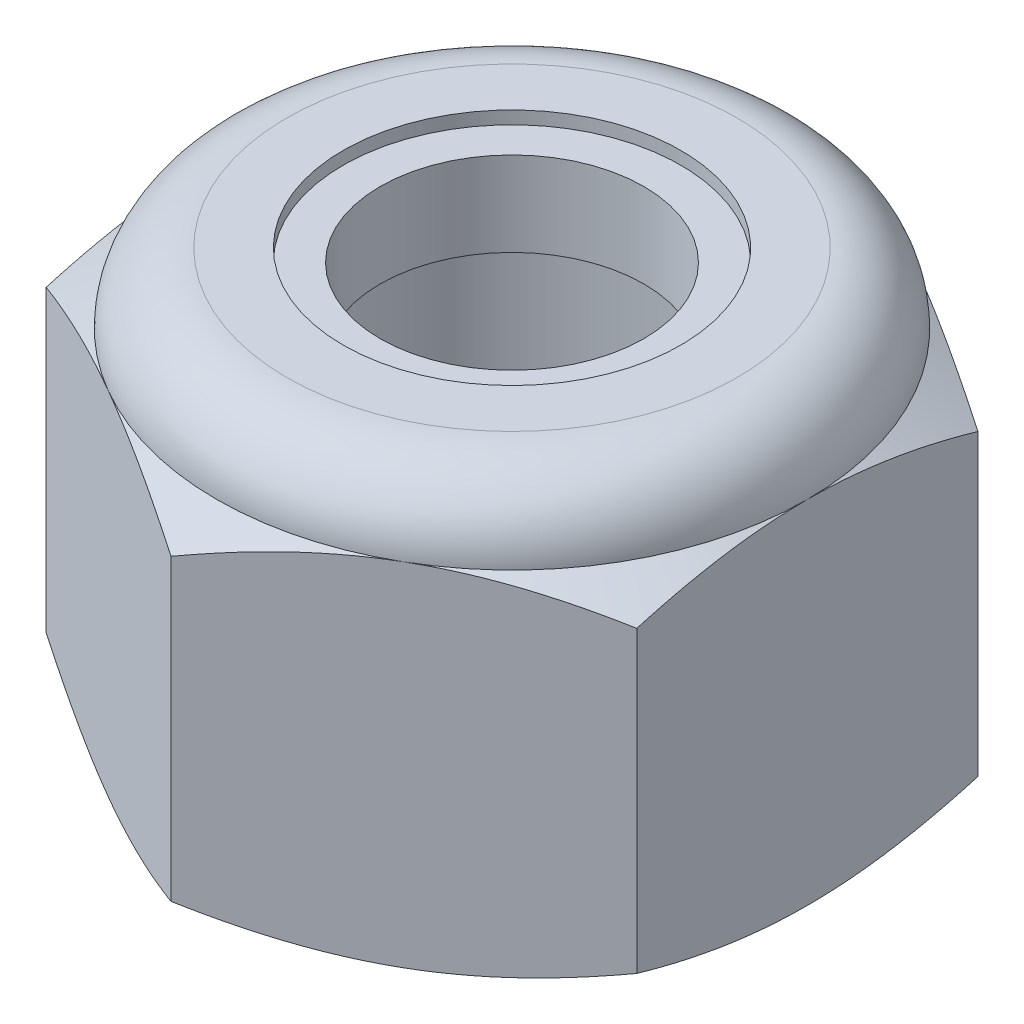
ISO-10303-21;
HEADER;
FILE_DESCRIPTION(('STEP AP214'),'2;1');
FILE_NAME('part.step','',(''),(''),'','','');
FILE_SCHEMA(('AUTOMOTIVE_DESIGN { 1 0 10303 214 1 1 1 1 }'));
ENDSEC;
DATA;
#1=APPLICATION_CONTEXT('core data for automotive mechanical design processes');
#2=APPLICATION_PROTOCOL_DEFINITION('international standard','automotive_design',2000,#1);
#3=PRODUCT_CONTEXT('',#1,'mechanical');
#4=PRODUCT('Part','Part','',(#3));
#5=PRODUCT_RELATED_PRODUCT_CATEGORY('part','',(#4));
#6=PRODUCT_DEFINITION_FORMATION('','',#4);
#7=PRODUCT_DEFINITION_CONTEXT('part definition',#1,'design');
#8=PRODUCT_DEFINITION('design','',#6,#7);
#9=PRODUCT_DEFINITION_SHAPE('','',#8);
#10=(LENGTH_UNIT() NAMED_UNIT(*) SI_UNIT(.MILLI.,.METRE.));
#11=(NAMED_UNIT(*) PLANE_ANGLE_UNIT() SI_UNIT($,.RADIAN.));
#12=(NAMED_UNIT(*) SI_UNIT($,.STERADIAN.) SOLID_ANGLE_UNIT());
#13=UNCERTAINTY_MEASURE_WITH_UNIT(LENGTH_MEASURE(1.E-05),#10,'distance_accuracy_value','');
#14=(GEOMETRIC_REPRESENTATION_CONTEXT(3) GLOBAL_UNCERTAINTY_ASSIGNED_CONTEXT((#13)) GLOBAL_UNIT_ASSIGNED_CONTEXT((#10,
#11,#12)) REPRESENTATION_CONTEXT('',''));
#15=CARTESIAN_POINT('',(0.,0.,0.));
#16=DIRECTION('',(0.,0.,1.));
#17=DIRECTION('',(1.,0.,0.));
#18=AXIS2_PLACEMENT_3D('',#15,#16,#17);
#19=CARTESIAN_POINT('',(0.,3.8476,0.));
#20=DIRECTION('',(0.,1.,0.));
#21=DIRECTION('',(0.,0.,1.));
#22=AXIS2_PLACEMENT_3D('',#19,#20,#21);
#23=CYLINDRICAL_SURFACE('',#22,2.);
#24=CARTESIAN_POINT('',(0.,3.8476,0.));
#25=DIRECTION('',(0.,1.,0.));
#26=DIRECTION('',(0.,0.,1.));
#27=AXIS2_PLACEMENT_3D('',#24,#25,#26);
#28=CIRCLE('',#27,2.);
#29=CARTESIAN_POINT('',(0.,3.8476,2.));
#30=VERTEX_POINT('',#29);
#31=EDGE_CURVE('E12',#30,#30,#28,.T.);
#32=ORIENTED_EDGE('',*,*,#31,.T.);
#33=EDGE_LOOP('',(#32));
#34=FACE_BOUND('',#33,.T.);
#35=CARTESIAN_POINT('',(0.,4.8476,0.));
#36=DIRECTION('',(0.,1.,0.));
#37=DIRECTION('',(0.,0.,1.));
#38=AXIS2_PLACEMENT_3D('',#35,#36,#37);
#39=CIRCLE('',#38,2.);
#40=CARTESIAN_POINT('',(0.,4.8476,2.));
#41=VERTEX_POINT('',#40);
#42=EDGE_CURVE('E48',#41,#41,#39,.T.);
#43=ORIENTED_EDGE('',*,*,#42,.F.);
#44=EDGE_LOOP('',(#43));
#45=FACE_BOUND('',#44,.T.);
#46=ADVANCED_FACE('F45',(#34,#45),#23,.T.);
#47=CARTESIAN_POINT('',(0.,3.8476,0.));
#48=DIRECTION('',(0.,1.,0.));
#49=DIRECTION('',(0.,0.,1.));
#50=AXIS2_PLACEMENT_3D('',#47,#48,#49);
#51=PLANE('',#50);
#52=CARTESIAN_POINT('',(0.,3.8476,0.));
#53=DIRECTION('',(0.,1.,0.));
#54=DIRECTION('',(0.,0.,1.));
#55=AXIS2_PLACEMENT_3D('',#52,#53,#54);
#56=CIRCLE('',#55,1.5625);
#57=CARTESIAN_POINT('',(0.,3.8476,1.5625));
#58=VERTEX_POINT('',#57);
#59=EDGE_CURVE('E55',#58,#58,#56,.T.);
#60=ORIENTED_EDGE('',*,*,#59,.T.);
#61=EDGE_LOOP('',(#60));
#62=FACE_BOUND('',#61,.T.);
#63=ORIENTED_EDGE('',*,*,#31,.F.);
#64=EDGE_LOOP('',(#63));
#65=FACE_BOUND('',#64,.T.);
#66=ADVANCED_FACE('F63',(#62,#65),#51,.F.);
#67=CARTESIAN_POINT('',(0.,4.8476,0.));
#68=DIRECTION('',(0.,1.,0.));
#69=DIRECTION('',(0.,0.,1.));
#70=AXIS2_PLACEMENT_3D('',#67,#68,#69);
#71=PLANE('',#70);
#72=CARTESIAN_POINT('',(0.,4.8476,0.));
#73=DIRECTION('',(0.,1.,0.));
#74=DIRECTION('',(0.,0.,1.));
#75=AXIS2_PLACEMENT_3D('',#72,#73,#74);
#76=CIRCLE('',#75,1.5625);
#77=CARTESIAN_POINT('',(0.,4.8476,1.5625));
#78=VERTEX_POINT('',#77);
#79=EDGE_CURVE('E57',#78,#78,#76,.T.);
#80=ORIENTED_EDGE('',*,*,#79,.F.);
#81=EDGE_LOOP('',(#80));
#82=FACE_BOUND('',#81,.T.);
#83=ORIENTED_EDGE('',*,*,#42,.T.);
#84=EDGE_LOOP('',(#83));
#85=FACE_BOUND('',#84,.T.);
#86=ADVANCED_FACE('F69',(#82,#85),#71,.T.);
#87=CARTESIAN_POINT('',(0.,3.8476,0.));
#88=DIRECTION('',(0.,1.,0.));
#89=DIRECTION('',(0.,0.,1.));
#90=AXIS2_PLACEMENT_3D('',#87,#88,#89);
#91=CYLINDRICAL_SURFACE('',#90,1.5625);
#92=ORIENTED_EDGE('',*,*,#59,.F.);
#93=EDGE_LOOP('',(#92));
#94=FACE_BOUND('',#93,.T.);
#95=ORIENTED_EDGE('',*,*,#79,.T.);
#96=EDGE_LOOP('',(#95));
#97=FACE_BOUND('',#96,.T.);
#98=ADVANCED_FACE('F66',(#94,#97),#91,.F.);
#99=CLOSED_SHELL('',(#46,#66,#86,#98));
#100=MANIFOLD_SOLID_BREP('B2',#99);
#101=CARTESIAN_POINT('',(3.5,5.,-2.0207259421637));
#102=DIRECTION('',(-0.5,0.,0.866025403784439));
#103=DIRECTION('',(0.866025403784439,0.,0.5));
#104=AXIS2_PLACEMENT_3D('',#101,#102,#103);
#105=PLANE('',#104);
#106=CARTESIAN_POINT('',(-0.000199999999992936,0.31267406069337,-4.04156735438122));
#107=CARTESIAN_POINT('',(0.153607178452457,0.261385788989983,-3.9527667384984));
#108=CARTESIAN_POINT('',(0.308742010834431,0.214740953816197,-3.86319960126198));
#109=CARTESIAN_POINT('',(0.621698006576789,0.133321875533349,-3.68251437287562));
#110=CARTESIAN_POINT('',(0.779524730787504,0.0985764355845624,-3.59139307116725));
#111=CARTESIAN_POINT('',(1.09322221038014,0.0444900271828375,-3.41027974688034));
#112=CARTESIAN_POINT('',(1.2490446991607,0.0247890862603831,-3.32031559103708));
#113=CARTESIAN_POINT('',(1.56142288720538,0.00127013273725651,-3.13996396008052));
#114=CARTESIAN_POINT('',(1.71797745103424,-0.0025673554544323,-3.04957714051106));
#115=CARTESIAN_POINT('',(2.010509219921,0.00541530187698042,-2.88068384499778));
#116=CARTESIAN_POINT('',(2.14653021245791,0.0152754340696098,-2.80215208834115));
#117=CARTESIAN_POINT('',(2.417686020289,0.046526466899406,-2.64560020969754));
#118=CARTESIAN_POINT('',(2.55281989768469,0.0679280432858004,-2.5675806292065));
#119=CARTESIAN_POINT('',(2.82453479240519,0.121430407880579,-2.41070596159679));
#120=CARTESIAN_POINT('',(2.96108141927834,0.153757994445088,-2.33187072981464));
#121=CARTESIAN_POINT('',(3.2321380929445,0.227128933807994,-2.17537608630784));
#122=CARTESIAN_POINT('',(3.36665161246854,0.268155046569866,-2.09771466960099));
#123=CARTESIAN_POINT('',(3.5002,0.31267406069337,-2.02061047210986));
#124=B_SPLINE_CURVE_WITH_KNOTS('',3,(#106,#107,#108,#109,#110,#111,#112,#113,#114,#115,#116,
#117,#118,#119,#120,#121,#122,#123),.UNSPECIFIED.,.F.,.F.,(4,2,2,2,2,2,2,2,4),(0.,
0.554793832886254,1.11092123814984,1.65328467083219,2.19498204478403,2.6666513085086,
3.13875761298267,3.62133612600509,4.10296698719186),.UNSPECIFIED.);
#125=CARTESIAN_POINT('',(0.,0.312607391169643,-4.04145188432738));
#126=VERTEX_POINT('',#125);
#127=CARTESIAN_POINT('',(1.75,0.,-3.03108891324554));
#128=VERTEX_POINT('',#127);
#129=EDGE_CURVE('E229',#126,#128,#124,.T.);
#130=ORIENTED_EDGE('',*,*,#129,.F.);
#131=DIRECTION('',(0.,-1.,0.));
#132=VECTOR('',#131,1.);
#133=CARTESIAN_POINT('',(0.,5.,-4.04145188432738));
#134=LINE('',#133,#132);
#135=CARTESIAN_POINT('',(0.,3.85405927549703,-4.04145188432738));
#136=VERTEX_POINT('',#135);
#137=EDGE_CURVE('E352',#136,#126,#134,.T.);
#138=ORIENTED_EDGE('',*,*,#137,.F.);
#139=CARTESIAN_POINT('',(3.5002,3.8539926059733,-2.02061047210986));
#140=CARTESIAN_POINT('',(3.34639282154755,3.90528087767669,-2.10941108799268));
#141=CARTESIAN_POINT('',(3.19125798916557,3.95192571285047,-2.1989782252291));
#142=CARTESIAN_POINT('',(2.87830199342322,4.03334479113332,-2.37966345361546));
#143=CARTESIAN_POINT('',(2.7204752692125,4.0680902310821,-2.47078475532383));
#144=CARTESIAN_POINT('',(2.40677778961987,4.12217663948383,-2.65189807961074));
#145=CARTESIAN_POINT('',(2.25095530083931,4.14187758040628,-2.741862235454));
#146=CARTESIAN_POINT('',(1.93857711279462,4.16539653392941,-2.92221386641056));
#147=CARTESIAN_POINT('',(1.78202254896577,4.1692340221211,-3.01260068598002));
#148=CARTESIAN_POINT('',(1.48949078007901,4.16125136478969,-3.18149398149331));
#149=CARTESIAN_POINT('',(1.35346978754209,4.15139123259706,-3.26002573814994));
#150=CARTESIAN_POINT('',(1.08231397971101,4.12014019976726,-3.41657761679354));
#151=CARTESIAN_POINT('',(0.947180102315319,4.09873862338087,-3.49459719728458));
#152=CARTESIAN_POINT('',(0.675465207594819,4.04523625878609,-3.65147186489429));
#153=CARTESIAN_POINT('',(0.538918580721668,4.01290867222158,-3.73030709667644));
#154=CARTESIAN_POINT('',(0.267861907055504,3.93953773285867,-3.88680174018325));
#155=CARTESIAN_POINT('',(0.13334838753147,3.8985116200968,-3.96446315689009));
#156=CARTESIAN_POINT('',(-0.000199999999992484,3.8539926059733,-4.04156735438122));
#157=B_SPLINE_CURVE_WITH_KNOTS('',3,(#139,#140,#141,#142,#143,#144,#145,#146,#147,#148,#149,
#150,#151,#152,#153,#154,#155,#156),.UNSPECIFIED.,.F.,.F.,(4,2,2,2,2,2,2,2,4),(0.,
0.554793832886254,1.11092123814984,1.65328467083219,2.19498204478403,2.6666513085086,
3.13875761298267,3.62133612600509,4.10296698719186),.UNSPECIFIED.);
#158=CARTESIAN_POINT('',(1.75,4.16666666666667,-3.03108891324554));
#159=VERTEX_POINT('',#158);
#160=EDGE_CURVE('E320',#159,#136,#157,.T.);
#161=ORIENTED_EDGE('',*,*,#160,.F.);
#162=CARTESIAN_POINT('',(3.5,3.85405927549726,-2.02072594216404));
#163=VERTEX_POINT('',#162);
#164=EDGE_CURVE('E375',#163,#159,#157,.T.);
#165=ORIENTED_EDGE('',*,*,#164,.F.);
#166=DIRECTION('',(0.,-1.,0.));
#167=VECTOR('',#166,1.);
#168=CARTESIAN_POINT('',(3.5,5.,-2.0207259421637));
#169=LINE('',#168,#167);
#170=CARTESIAN_POINT('',(3.5,0.312607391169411,-2.02072594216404));
#171=VERTEX_POINT('',#170);
#172=EDGE_CURVE('E361',#163,#171,#169,.T.);
#173=ORIENTED_EDGE('',*,*,#172,.T.);
#174=EDGE_CURVE('E210',#128,#171,#124,.T.);
#175=ORIENTED_EDGE('',*,*,#174,.F.);
#176=EDGE_LOOP('',(#130,#138,#161,#165,#173,#175));
#177=FACE_BOUND('',#176,.T.);
#178=ADVANCED_FACE('F113',(#177),#105,.F.);
#179=CARTESIAN_POINT('',(0.,5.,-4.04145188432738));
#180=DIRECTION('',(0.499999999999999,0.,0.866025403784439));
#181=DIRECTION('',(0.866025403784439,0.,-0.499999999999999));
#182=AXIS2_PLACEMENT_3D('',#179,#180,#181);
#183=PLANE('',#182);
#184=CARTESIAN_POINT('',(-3.5002,0.31267406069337,-2.02061047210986));
#185=CARTESIAN_POINT('',(-3.34639282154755,0.261385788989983,-2.10941108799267));
#186=CARTESIAN_POINT('',(-3.19125798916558,0.214740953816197,-2.19897822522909));
#187=CARTESIAN_POINT('',(-2.87830199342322,0.133321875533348,-2.37966345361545));
#188=CARTESIAN_POINT('',(-2.7204752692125,0.0985764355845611,-2.47078475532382));
#189=CARTESIAN_POINT('',(-2.40677778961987,0.0444900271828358,-2.65189807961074));
#190=CARTESIAN_POINT('',(-2.25095530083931,0.0247890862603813,-2.74186223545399));
#191=CARTESIAN_POINT('',(-1.93857711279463,0.00127013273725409,-2.92221386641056));
#192=CARTESIAN_POINT('',(-1.78202254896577,-0.00256735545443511,-3.01260068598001));
#193=CARTESIAN_POINT('',(-1.48949078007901,0.00541530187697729,-3.1814939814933));
#194=CARTESIAN_POINT('',(-1.35346978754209,0.0152754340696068,-3.26002573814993));
#195=CARTESIAN_POINT('',(-1.082313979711,0.0465264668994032,-3.41657761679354));
#196=CARTESIAN_POINT('',(-0.947180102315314,0.0679280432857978,-3.49459719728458));
#197=CARTESIAN_POINT('',(-0.675465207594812,0.121430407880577,-3.65147186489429));
#198=CARTESIAN_POINT('',(-0.53891858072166,0.153757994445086,-3.73030709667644));
#199=CARTESIAN_POINT('',(-0.267861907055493,0.227128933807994,-3.88680174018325));
#200=CARTESIAN_POINT('',(-0.133348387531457,0.268155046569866,-3.96446315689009));
#201=CARTESIAN_POINT('',(0.000200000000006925,0.31267406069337,-4.04156735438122));
#202=B_SPLINE_CURVE_WITH_KNOTS('',3,(#184,#185,#186,#187,#188,#189,#190,#191,#192,#193,#194,
#195,#196,#197,#198,#199,#200,#201),.UNSPECIFIED.,.F.,.F.,(4,2,2,2,2,2,2,2,4),(0.,
0.554793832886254,1.11092123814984,1.65328467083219,2.19498204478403,2.6666513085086,
3.13875761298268,3.6213361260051,4.10296698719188),.UNSPECIFIED.);
#203=CARTESIAN_POINT('',(-3.5,0.312607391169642,-2.02072594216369));
#204=VERTEX_POINT('',#203);
#205=CARTESIAN_POINT('',(-1.75,0.,-3.03108891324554));
#206=VERTEX_POINT('',#205);
#207=EDGE_CURVE('E340',#204,#206,#202,.T.);
#208=ORIENTED_EDGE('',*,*,#207,.F.);
#209=DIRECTION('',(0.,-1.,0.));
#210=VECTOR('',#209,1.);
#211=CARTESIAN_POINT('',(-3.5,5.,-2.02072594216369));
#212=LINE('',#211,#210);
#213=CARTESIAN_POINT('',(-3.5,3.85405927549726,-2.02072594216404));
#214=VERTEX_POINT('',#213);
#215=EDGE_CURVE('E343',#214,#204,#212,.T.);
#216=ORIENTED_EDGE('',*,*,#215,.F.);
#217=CARTESIAN_POINT('',(0.000200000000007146,3.8539926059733,-4.04156735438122));
#218=CARTESIAN_POINT('',(-0.153607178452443,3.90528087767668,-3.9527667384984));
#219=CARTESIAN_POINT('',(-0.308742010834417,3.95192571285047,-3.86319960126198));
#220=CARTESIAN_POINT('',(-0.621698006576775,4.03334479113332,-3.68251437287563));
#221=CARTESIAN_POINT('',(-0.77952473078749,4.06809023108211,-3.59139307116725));
#222=CARTESIAN_POINT('',(-1.09322221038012,4.12217663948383,-3.41027974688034));
#223=CARTESIAN_POINT('',(-1.24904469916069,4.14187758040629,-3.32031559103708));
#224=CARTESIAN_POINT('',(-1.56142288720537,4.16539653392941,-3.13996396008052));
#225=CARTESIAN_POINT('',(-1.71797745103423,4.1692340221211,-3.04957714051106));
#226=CARTESIAN_POINT('',(-2.01050921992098,4.16125136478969,-2.88068384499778));
#227=CARTESIAN_POINT('',(-2.1465302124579,4.15139123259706,-2.80215208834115));
#228=CARTESIAN_POINT('',(-2.41768602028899,4.12014019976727,-2.64560020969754));
#229=CARTESIAN_POINT('',(-2.55281989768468,4.09873862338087,-2.5675806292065));
#230=CARTESIAN_POINT('',(-2.82453479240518,4.04523625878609,-2.41070596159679));
#231=CARTESIAN_POINT('',(-2.96108141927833,4.01290867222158,-2.33187072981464));
#232=CARTESIAN_POINT('',(-3.2321380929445,3.93953773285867,-2.17537608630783));
#233=CARTESIAN_POINT('',(-3.36665161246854,3.8985116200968,-2.09771466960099));
#234=CARTESIAN_POINT('',(-3.5002,3.8539926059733,-2.02061047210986));
#235=B_SPLINE_CURVE_WITH_KNOTS('',3,(#217,#218,#219,#220,#221,#222,#223,#224,#225,#226,#227,
#228,#229,#230,#231,#232,#233,#234),.UNSPECIFIED.,.F.,.F.,(4,2,2,2,2,2,2,2,4),(0.,
0.554793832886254,1.11092123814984,1.65328467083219,2.19498204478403,2.6666513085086,
3.13875761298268,3.6213361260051,4.10296698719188),.UNSPECIFIED.);
#236=CARTESIAN_POINT('',(-1.75,4.16666666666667,-3.03108891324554));
#237=VERTEX_POINT('',#236);
#238=EDGE_CURVE('E313',#237,#214,#235,.T.);
#239=ORIENTED_EDGE('',*,*,#238,.F.);
#240=EDGE_CURVE('E319',#136,#237,#235,.T.);
#241=ORIENTED_EDGE('',*,*,#240,.F.);
#242=ORIENTED_EDGE('',*,*,#137,.T.);
#243=EDGE_CURVE('E230',#206,#126,#202,.T.);
#244=ORIENTED_EDGE('',*,*,#243,.F.);
#245=EDGE_LOOP('',(#208,#216,#239,#241,#242,#244));
#246=FACE_BOUND('',#245,.T.);
#247=ADVANCED_FACE('F326',(#246),#183,.F.);
#248=CARTESIAN_POINT('',(-3.5,5.,-2.02072594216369));
#249=DIRECTION('',(1.,0.,0.));
#250=DIRECTION('',(0.,0.,-1.));
#251=AXIS2_PLACEMENT_3D('',#248,#249,#250);
#252=PLANE('',#251);
#253=CARTESIAN_POINT('',(-3.5,1.72418329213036,-5.46104710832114));
#254=CARTESIAN_POINT('',(-3.5,1.64973387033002,-5.30784491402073));
#255=CARTESIAN_POINT('',(-3.5,1.57598898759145,-5.15429446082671));
#256=CARTESIAN_POINT('',(-3.5,1.43030407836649,-4.84631185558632));
#257=CARTESIAN_POINT('',(-3.5,1.35836433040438,-4.69187957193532));
#258=CARTESIAN_POINT('',(-3.5,1.21633091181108,-4.38116889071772));
#259=CARTESIAN_POINT('',(-3.5,1.1462491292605,-4.22488504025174));
#260=CARTESIAN_POINT('',(-3.5,1.00891129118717,-3.91108522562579));
#261=CARTESIAN_POINT('',(-3.5,0.941655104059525,-3.75356931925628));
#262=CARTESIAN_POINT('',(-3.5,0.808604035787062,-3.43195522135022));
#263=CARTESIAN_POINT('',(-3.5,0.742925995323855,-3.26780843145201));
#264=CARTESIAN_POINT('',(-3.5,0.616460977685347,-2.93760703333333));
#265=CARTESIAN_POINT('',(-3.5,0.555674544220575,-2.77155221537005));
#266=CARTESIAN_POINT('',(-3.5,0.440563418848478,-2.43757026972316));
#267=CARTESIAN_POINT('',(-3.5,0.386225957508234,-2.269647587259));
#268=CARTESIAN_POINT('',(-3.5,0.285733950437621,-1.93139420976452));
#269=CARTESIAN_POINT('',(-3.5,0.239576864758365,-1.76106427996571));
#270=CARTESIAN_POINT('',(-3.5,0.157871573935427,-1.41879566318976));
#271=CARTESIAN_POINT('',(-3.5,0.122267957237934,-1.24687044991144));
#272=CARTESIAN_POINT('',(-3.5,0.0636788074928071,-0.900848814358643));
#273=CARTESIAN_POINT('',(-3.5,0.0406919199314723,-0.726752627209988));
#274=CARTESIAN_POINT('',(-3.5,0.00946908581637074,-0.379544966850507));
#275=CARTESIAN_POINT('',(-3.5,0.00104093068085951,-0.206451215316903));
#276=CARTESIAN_POINT('',(-3.5,-0.000857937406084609,0.139837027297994));
#277=CARTESIAN_POINT('',(-3.5,0.00567185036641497,0.313031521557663));
#278=CARTESIAN_POINT('',(-3.5,0.0289039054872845,0.605999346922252));
#279=CARTESIAN_POINT('',(-3.5,0.0419310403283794,0.726082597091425));
#280=CARTESIAN_POINT('',(-3.5,0.0743836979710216,0.965387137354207));
#281=CARTESIAN_POINT('',(-3.5,0.0938100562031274,1.0846083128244));
#282=CARTESIAN_POINT('',(-3.5,0.160668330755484,1.44080185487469));
#283=CARTESIAN_POINT('',(-3.5,0.216668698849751,1.67618474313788));
#284=CARTESIAN_POINT('',(-3.5,0.314033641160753,2.0283688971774));
#285=CARTESIAN_POINT('',(-3.5,0.349205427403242,2.14698601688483));
#286=CARTESIAN_POINT('',(-3.5,0.423259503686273,2.38306754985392));
#287=CARTESIAN_POINT('',(-3.5,0.462141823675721,2.5005319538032));
#288=CARTESIAN_POINT('',(-3.5,0.542988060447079,2.73434747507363));
#289=CARTESIAN_POINT('',(-3.5,0.584951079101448,2.85069890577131));
#290=CARTESIAN_POINT('',(-3.5,0.671459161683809,3.08243090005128));
#291=CARTESIAN_POINT('',(-3.5,0.716004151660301,3.19781149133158));
#292=CARTESIAN_POINT('',(-3.5,0.847875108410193,3.53010242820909));
#293=CARTESIAN_POINT('',(-3.5,0.937968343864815,3.74591384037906));
#294=CARTESIAN_POINT('',(-3.5,1.1236764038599,4.17515714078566));
#295=CARTESIAN_POINT('',(-3.5,1.21929198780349,4.38858869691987));
#296=CARTESIAN_POINT('',(-3.5,1.41462237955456,4.81366884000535));
#297=CARTESIAN_POINT('',(-3.5,1.51433887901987,5.0253166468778));
#298=CARTESIAN_POINT('',(-3.5,1.71682010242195,5.44715232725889));
#299=CARTESIAN_POINT('',(-3.5,1.81958492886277,5.65734015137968));
#300=CARTESIAN_POINT('',(-3.5,2.02762659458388,6.07692723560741));
#301=CARTESIAN_POINT('',(-3.5,2.1329075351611,6.28632445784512));
#302=CARTESIAN_POINT('',(-3.5,2.34529474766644,6.70419213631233));
#303=CARTESIAN_POINT('',(-3.5,2.45240103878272,6.91266258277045));
#304=CARTESIAN_POINT('',(-3.5,2.77580685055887,7.53685082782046));
#305=CARTESIAN_POINT('',(-3.5,2.99424943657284,7.95145760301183));
#306=CARTESIAN_POINT('',(-3.5,3.40900389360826,8.73014947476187));
#307=CARTESIAN_POINT('',(-3.5,3.60490503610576,9.09445438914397));
#308=CARTESIAN_POINT('',(-3.5,3.9988212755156,9.82195451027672));
#309=CARTESIAN_POINT('',(-3.5,4.19683653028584,10.1851496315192));
#310=CARTESIAN_POINT('',(-3.5,4.59369841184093,10.9093913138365));
#311=CARTESIAN_POINT('',(-3.5,4.79253950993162,11.2704409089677));
#312=CARTESIAN_POINT('',(-3.5,5.1913927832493,11.9918505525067));
#313=CARTESIAN_POINT('',(-3.5,5.39140485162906,12.3522106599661));
#314=CARTESIAN_POINT('',(-3.5,5.59183923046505,12.712334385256));
#315=B_SPLINE_CURVE_WITH_KNOTS('',3,(#253,#254,#255,#256,#257,#258,#259,#260,#261,#262,#263,
#264,#265,#266,#267,#268,#269,#270,#271,#272,#273,#274,#275,#276,#277,#278,#279,#280,#281,#282,
#283,#284,#285,#286,#287,#288,#289,#290,#291,#292,#293,#294,#295,#296,#297,#298,#299,#300,#301,
#302,#303,#304,#305,#306,#307,#308,#309,#310,#311,#312,#313,#314),.UNSPECIFIED.,.F.,.F.,(4,2,2,
2,2,2,2,2,2,2,2,2,2,2,2,2,2,2,2,2,2,2,2,2,2,2,2,2,2,2,4),(0.,0.511007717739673,1.02209380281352,
1.5359049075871,2.04969205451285,2.58002782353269,3.11042245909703,3.63974870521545,
4.16891031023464,4.69524219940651,5.22151757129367,5.74079023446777,6.26008028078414,
6.62226887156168,6.98450476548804,7.70933484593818,8.08046770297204,8.45160355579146,
8.82263163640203,9.19364909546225,9.89511289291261,10.5966733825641,11.298526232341,
12.0004027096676,12.7035139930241,13.4066326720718,14.8124940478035,16.0533973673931,
17.2943940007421,18.5309398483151,19.7673745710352),.UNSPECIFIED.);
#316=CARTESIAN_POINT('',(-3.5,0.312607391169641,2.02072594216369));
#317=VERTEX_POINT('',#316);
#318=CARTESIAN_POINT('',(-3.5,0.,0.));
#319=VERTEX_POINT('',#318);
#320=EDGE_CURVE('E417',#317,#319,#315,.F.);
#321=ORIENTED_EDGE('',*,*,#320,.F.);
#322=DIRECTION('',(0.,-1.,0.));
#323=VECTOR('',#322,1.);
#324=CARTESIAN_POINT('',(-3.5,5.,2.02072594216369));
#325=LINE('',#324,#323);
#326=CARTESIAN_POINT('',(-3.5,3.85405927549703,2.02072594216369));
#327=VERTEX_POINT('',#326);
#328=EDGE_CURVE('E353',#327,#317,#325,.T.);
#329=ORIENTED_EDGE('',*,*,#328,.F.);
#330=CARTESIAN_POINT('',(-3.5,2.44248337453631,-5.46104710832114));
#331=CARTESIAN_POINT('',(-3.5,2.51693279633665,-5.30784491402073));
#332=CARTESIAN_POINT('',(-3.5,2.59067767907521,-5.15429446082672));
#333=CARTESIAN_POINT('',(-3.5,2.73636258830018,-4.84631185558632));
#334=CARTESIAN_POINT('',(-3.5,2.80830233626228,-4.69187957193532));
#335=CARTESIAN_POINT('',(-3.5,2.95033575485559,-4.38116889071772));
#336=CARTESIAN_POINT('',(-3.5,3.02041753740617,-4.22488504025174));
#337=CARTESIAN_POINT('',(-3.5,3.1577553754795,-3.91108522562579));
#338=CARTESIAN_POINT('',(-3.5,3.22501156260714,-3.75356931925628));
#339=CARTESIAN_POINT('',(-3.5,3.35806263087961,-3.43195522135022));
#340=CARTESIAN_POINT('',(-3.5,3.42374067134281,-3.26780843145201));
#341=CARTESIAN_POINT('',(-3.5,3.55020568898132,-2.93760703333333));
#342=CARTESIAN_POINT('',(-3.5,3.61099212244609,-2.77155221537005));
#343=CARTESIAN_POINT('',(-3.5,3.72610324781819,-2.43757026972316));
#344=CARTESIAN_POINT('',(-3.5,3.78044070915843,-2.269647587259));
#345=CARTESIAN_POINT('',(-3.5,3.88093271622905,-1.93139420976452));
#346=CARTESIAN_POINT('',(-3.5,3.9270898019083,-1.76106427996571));
#347=CARTESIAN_POINT('',(-3.5,4.00879509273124,-1.41879566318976));
#348=CARTESIAN_POINT('',(-3.5,4.04439870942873,-1.24687044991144));
#349=CARTESIAN_POINT('',(-3.5,4.10298785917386,-0.900848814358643));
#350=CARTESIAN_POINT('',(-3.5,4.1259747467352,-0.726752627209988));
#351=CARTESIAN_POINT('',(-3.5,4.1571975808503,-0.379544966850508));
#352=CARTESIAN_POINT('',(-3.5,4.16562573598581,-0.206451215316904));
#353=CARTESIAN_POINT('',(-3.5,4.16752460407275,0.139837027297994));
#354=CARTESIAN_POINT('',(-3.5,4.16099481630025,0.313031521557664));
#355=CARTESIAN_POINT('',(-3.5,4.13776276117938,0.605999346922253));
#356=CARTESIAN_POINT('',(-3.5,4.12473562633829,0.726082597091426));
#357=CARTESIAN_POINT('',(-3.5,4.09228296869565,0.965387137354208));
#358=CARTESIAN_POINT('',(-3.5,4.07285661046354,1.0846083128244));
#359=CARTESIAN_POINT('',(-3.5,4.00599833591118,1.44080185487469));
#360=CARTESIAN_POINT('',(-3.5,3.94999796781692,1.67618474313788));
#361=CARTESIAN_POINT('',(-3.5,3.85263302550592,2.0283688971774));
#362=CARTESIAN_POINT('',(-3.5,3.81746123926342,2.14698601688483));
#363=CARTESIAN_POINT('',(-3.5,3.74340716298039,2.38306754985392));
#364=CARTESIAN_POINT('',(-3.5,3.70452484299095,2.5005319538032));
#365=CARTESIAN_POINT('',(-3.5,3.62367860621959,2.73434747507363));
#366=CARTESIAN_POINT('',(-3.5,3.58171558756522,2.85069890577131));
#367=CARTESIAN_POINT('',(-3.5,3.49520750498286,3.08243090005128));
#368=CARTESIAN_POINT('',(-3.5,3.45066251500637,3.19781149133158));
#369=CARTESIAN_POINT('',(-3.5,3.31879155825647,3.53010242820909));
#370=CARTESIAN_POINT('',(-3.5,3.22869832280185,3.74591384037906));
#371=CARTESIAN_POINT('',(-3.5,3.04299026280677,4.17515714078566));
#372=CARTESIAN_POINT('',(-3.5,2.94737467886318,4.38858869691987));
#373=CARTESIAN_POINT('',(-3.5,2.75204428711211,4.81366884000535));
#374=CARTESIAN_POINT('',(-3.5,2.6523277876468,5.0253166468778));
#375=CARTESIAN_POINT('',(-3.5,2.44984656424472,5.44715232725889));
#376=CARTESIAN_POINT('',(-3.5,2.34708173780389,5.65734015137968));
#377=CARTESIAN_POINT('',(-3.5,2.13904007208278,6.07692723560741));
#378=CARTESIAN_POINT('',(-3.5,2.03375913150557,6.28632445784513));
#379=CARTESIAN_POINT('',(-3.5,1.82137191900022,6.70419213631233));
#380=CARTESIAN_POINT('',(-3.5,1.71426562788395,6.91266258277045));
#381=CARTESIAN_POINT('',(-3.5,1.3908598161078,7.53685082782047));
#382=CARTESIAN_POINT('',(-3.5,1.17241723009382,7.95145760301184));
#383=CARTESIAN_POINT('',(-3.5,0.757662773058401,8.73014947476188));
#384=CARTESIAN_POINT('',(-3.5,0.561761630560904,9.09445438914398));
#385=CARTESIAN_POINT('',(-3.5,0.167845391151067,9.82195451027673));
#386=CARTESIAN_POINT('',(-3.5,-0.0301698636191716,10.1851496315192));
#387=CARTESIAN_POINT('',(-3.5,-0.427031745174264,10.9093913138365));
#388=CARTESIAN_POINT('',(-3.5,-0.625872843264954,11.2704409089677));
#389=CARTESIAN_POINT('',(-3.5,-1.02472611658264,11.9918505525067));
#390=CARTESIAN_POINT('',(-3.5,-1.2247381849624,12.3522106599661));
#391=CARTESIAN_POINT('',(-3.5,-1.42517256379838,12.712334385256));
#392=B_SPLINE_CURVE_WITH_KNOTS('',3,(#330,#331,#332,#333,#334,#335,#336,#337,#338,#339,#340,
#341,#342,#343,#344,#345,#346,#347,#348,#349,#350,#351,#352,#353,#354,#355,#356,#357,#358,#359,
#360,#361,#362,#363,#364,#365,#366,#367,#368,#369,#370,#371,#372,#373,#374,#375,#376,#377,#378,
#379,#380,#381,#382,#383,#384,#385,#386,#387,#388,#389,#390,#391),.UNSPECIFIED.,.F.,.F.,(4,2,2,
2,2,2,2,2,2,2,2,2,2,2,2,2,2,2,2,2,2,2,2,2,2,2,2,2,2,2,4),(0.,0.511007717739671,1.02209380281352,
1.5359049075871,2.04969205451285,2.58002782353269,3.11042245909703,3.63974870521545,
4.16891031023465,4.69524219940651,5.22151757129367,5.74079023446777,6.26008028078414,
6.62226887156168,6.98450476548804,7.70933484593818,8.08046770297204,8.45160355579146,
8.82263163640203,9.19364909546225,9.89511289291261,10.5966733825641,11.298526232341,
12.0004027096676,12.7035139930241,13.4066326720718,14.8124940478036,16.0533973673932,
17.2943940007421,18.5309398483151,19.7673745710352),.UNSPECIFIED.);
#393=CARTESIAN_POINT('',(-3.5,4.16666666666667,0.));
#394=VERTEX_POINT('',#393);
#395=EDGE_CURVE('E306',#394,#327,#392,.T.);
#396=ORIENTED_EDGE('',*,*,#395,.F.);
#397=EDGE_CURVE('E312',#214,#394,#392,.T.);
#398=ORIENTED_EDGE('',*,*,#397,.F.);
#399=ORIENTED_EDGE('',*,*,#215,.T.);
#400=EDGE_CURVE('E265',#319,#204,#315,.F.);
#401=ORIENTED_EDGE('',*,*,#400,.F.);
#402=EDGE_LOOP('',(#321,#329,#396,#398,#399,#401));
#403=FACE_BOUND('',#402,.T.);
#404=ADVANCED_FACE('F287',(#403),#252,.F.);
#405=CARTESIAN_POINT('',(-3.5,5.,2.02072594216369));
#406=DIRECTION('',(0.5,0.,-0.866025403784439));
#407=DIRECTION('',(-0.866025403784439,0.,-0.5));
#408=AXIS2_PLACEMENT_3D('',#405,#406,#407);
#409=PLANE('',#408);
#410=CARTESIAN_POINT('',(0.000199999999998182,0.312674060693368,4.04156735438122));
#411=CARTESIAN_POINT('',(-0.153607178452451,0.26138578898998,3.9527667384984));
#412=CARTESIAN_POINT('',(-0.308742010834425,0.214740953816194,3.86319960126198));
#413=CARTESIAN_POINT('',(-0.621698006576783,0.133321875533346,3.68251437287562));
#414=CARTESIAN_POINT('',(-0.779524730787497,0.0985764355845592,3.59139307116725));
#415=CARTESIAN_POINT('',(-1.09322221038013,0.0444900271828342,3.41027974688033));
#416=CARTESIAN_POINT('',(-1.24904469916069,0.0247890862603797,3.32031559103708));
#417=CARTESIAN_POINT('',(-1.56142288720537,0.00127013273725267,3.13996396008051));
#418=CARTESIAN_POINT('',(-1.71797745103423,-0.00256735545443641,3.04957714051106));
#419=CARTESIAN_POINT('',(-2.01050921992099,0.00541530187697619,2.88068384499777));
#420=CARTESIAN_POINT('',(-2.14653021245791,0.0152754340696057,2.80215208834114));
#421=CARTESIAN_POINT('',(-2.417686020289,0.0465264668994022,2.64560020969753));
#422=CARTESIAN_POINT('',(-2.55281989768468,0.0679280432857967,2.56758062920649));
#423=CARTESIAN_POINT('',(-2.82453479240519,0.121430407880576,2.41070596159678));
#424=CARTESIAN_POINT('',(-2.96108141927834,0.153757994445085,2.33187072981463));
#425=CARTESIAN_POINT('',(-3.2321380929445,0.227128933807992,2.17537608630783));
#426=CARTESIAN_POINT('',(-3.36665161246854,0.268155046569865,2.09771466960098));
#427=CARTESIAN_POINT('',(-3.5002,0.312674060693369,2.02061047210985));
#428=B_SPLINE_CURVE_WITH_KNOTS('',3,(#410,#411,#412,#413,#414,#415,#416,#417,#418,#419,#420,
#421,#422,#423,#424,#425,#426,#427),.UNSPECIFIED.,.F.,.F.,(4,2,2,2,2,2,2,2,4),(0.,
0.554793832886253,1.11092123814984,1.65328467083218,2.19498204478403,2.6666513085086,
3.13875761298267,3.6213361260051,4.10296698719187),.UNSPECIFIED.);
#429=CARTESIAN_POINT('',(0.,0.31260739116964,4.04145188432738));
#430=VERTEX_POINT('',#429);
#431=CARTESIAN_POINT('',(-1.75,0.,3.03108891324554));
#432=VERTEX_POINT('',#431);
#433=EDGE_CURVE('E218',#430,#432,#428,.T.);
#434=ORIENTED_EDGE('',*,*,#433,.F.);
#435=DIRECTION('',(0.,-1.,0.));
#436=VECTOR('',#435,1.);
#437=CARTESIAN_POINT('',(0.,5.,4.04145188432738));
#438=LINE('',#437,#436);
#439=CARTESIAN_POINT('',(0.,3.85405927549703,4.04145188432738));
#440=VERTEX_POINT('',#439);
#441=EDGE_CURVE('E228',#440,#430,#438,.T.);
#442=ORIENTED_EDGE('',*,*,#441,.F.);
#443=CARTESIAN_POINT('',(-3.5002,3.8539926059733,2.02061047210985));
#444=CARTESIAN_POINT('',(-3.34639282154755,3.90528087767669,2.10941108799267));
#445=CARTESIAN_POINT('',(-3.19125798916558,3.95192571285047,2.19897822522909));
#446=CARTESIAN_POINT('',(-2.87830199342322,4.03334479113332,2.37966345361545));
#447=CARTESIAN_POINT('',(-2.72047526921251,4.06809023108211,2.47078475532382));
#448=CARTESIAN_POINT('',(-2.40677778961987,4.12217663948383,2.65189807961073));
#449=CARTESIAN_POINT('',(-2.25095530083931,4.14187758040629,2.74186223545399));
#450=CARTESIAN_POINT('',(-1.93857711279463,4.16539653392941,2.92221386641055));
#451=CARTESIAN_POINT('',(-1.78202254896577,4.1692340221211,3.01260068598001));
#452=CARTESIAN_POINT('',(-1.48949078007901,4.16125136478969,3.1814939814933));
#453=CARTESIAN_POINT('',(-1.3534697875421,4.15139123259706,3.26002573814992));
#454=CARTESIAN_POINT('',(-1.08231397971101,4.12014019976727,3.41657761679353));
#455=CARTESIAN_POINT('',(-0.947180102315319,4.09873862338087,3.49459719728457));
#456=CARTESIAN_POINT('',(-0.675465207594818,4.04523625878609,3.65147186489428));
#457=CARTESIAN_POINT('',(-0.538918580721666,4.01290867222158,3.73030709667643));
#458=CARTESIAN_POINT('',(-0.2678619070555,3.93953773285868,3.88680174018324));
#459=CARTESIAN_POINT('',(-0.133348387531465,3.8985116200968,3.96446315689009));
#460=CARTESIAN_POINT('',(0.000199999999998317,3.8539926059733,4.04156735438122));
#461=B_SPLINE_CURVE_WITH_KNOTS('',3,(#443,#444,#445,#446,#447,#448,#449,#450,#451,#452,#453,
#454,#455,#456,#457,#458,#459,#460),.UNSPECIFIED.,.F.,.F.,(4,2,2,2,2,2,2,2,4),(0.,
0.554793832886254,1.11092123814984,1.65328467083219,2.19498204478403,2.6666513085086,
3.13875761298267,3.6213361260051,4.10296698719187),.UNSPECIFIED.);
#462=CARTESIAN_POINT('',(-1.75,4.16666666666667,3.03108891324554));
#463=VERTEX_POINT('',#462);
#464=EDGE_CURVE('E292',#463,#440,#461,.T.);
#465=ORIENTED_EDGE('',*,*,#464,.F.);
#466=EDGE_CURVE('E299',#327,#463,#461,.T.);
#467=ORIENTED_EDGE('',*,*,#466,.F.);
#468=ORIENTED_EDGE('',*,*,#328,.T.);
#469=EDGE_CURVE('E232',#432,#317,#428,.T.);
#470=ORIENTED_EDGE('',*,*,#469,.F.);
#471=EDGE_LOOP('',(#434,#442,#465,#467,#468,#470));
#472=FACE_BOUND('',#471,.T.);
#473=ADVANCED_FACE('F284',(#472),#409,.F.);
#474=CARTESIAN_POINT('',(0.,5.,4.04145188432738));
#475=DIRECTION('',(-0.5,0.,-0.866025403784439));
#476=DIRECTION('',(-0.866025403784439,0.,0.5));
#477=AXIS2_PLACEMENT_3D('',#474,#475,#476);
#478=PLANE('',#477);
#479=CARTESIAN_POINT('',(3.5002,0.312674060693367,2.02061047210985));
#480=CARTESIAN_POINT('',(3.34639282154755,0.26138578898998,2.10941108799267));
#481=CARTESIAN_POINT('',(3.19125798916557,0.214740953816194,2.19897822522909));
#482=CARTESIAN_POINT('',(2.87830199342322,0.133321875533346,2.37966345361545));
#483=CARTESIAN_POINT('',(2.7204752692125,0.0985764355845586,2.47078475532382));
#484=CARTESIAN_POINT('',(2.40677778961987,0.0444900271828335,2.65189807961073));
#485=CARTESIAN_POINT('',(2.25095530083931,0.024789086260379,2.74186223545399));
#486=CARTESIAN_POINT('',(1.93857711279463,0.00127013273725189,2.92221386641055));
#487=CARTESIAN_POINT('',(1.78202254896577,-0.00256735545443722,3.01260068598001));
#488=CARTESIAN_POINT('',(1.48949078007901,0.00541530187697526,3.1814939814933));
#489=CARTESIAN_POINT('',(1.35346978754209,0.0152754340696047,3.26002573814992));
#490=CARTESIAN_POINT('',(1.082313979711,0.046526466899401,3.41657761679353));
#491=CARTESIAN_POINT('',(0.947180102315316,0.0679280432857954,3.49459719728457));
#492=CARTESIAN_POINT('',(0.675465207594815,0.121430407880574,3.65147186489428));
#493=CARTESIAN_POINT('',(0.538918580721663,0.153757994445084,3.73030709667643));
#494=CARTESIAN_POINT('',(0.267861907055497,0.227128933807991,3.88680174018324));
#495=CARTESIAN_POINT('',(0.133348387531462,0.268155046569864,3.96446315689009));
#496=CARTESIAN_POINT('',(-0.000200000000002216,0.312674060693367,4.04156735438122));
#497=B_SPLINE_CURVE_WITH_KNOTS('',3,(#479,#480,#481,#482,#483,#484,#485,#486,#487,#488,#489,
#490,#491,#492,#493,#494,#495,#496),.UNSPECIFIED.,.F.,.F.,(4,2,2,2,2,2,2,2,4),(0.,
0.554793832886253,1.11092123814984,1.65328467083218,2.19498204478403,2.6666513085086,
3.13875761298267,3.62133612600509,4.10296698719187),.UNSPECIFIED.);
#498=CARTESIAN_POINT('',(3.5,0.312607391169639,2.02072594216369));
#499=VERTEX_POINT('',#498);
#500=CARTESIAN_POINT('',(1.75,0.,3.03108891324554));
#501=VERTEX_POINT('',#500);
#502=EDGE_CURVE('E201',#499,#501,#497,.T.);
#503=ORIENTED_EDGE('',*,*,#502,.F.);
#504=DIRECTION('',(0.,-1.,0.));
#505=VECTOR('',#504,1.);
#506=CARTESIAN_POINT('',(3.5,5.,2.02072594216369));
#507=LINE('',#506,#505);
#508=CARTESIAN_POINT('',(3.5,3.85405927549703,2.02072594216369));
#509=VERTEX_POINT('',#508);
#510=EDGE_CURVE('E359',#509,#499,#507,.T.);
#511=ORIENTED_EDGE('',*,*,#510,.F.);
#512=CARTESIAN_POINT('',(-0.000200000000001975,3.8539926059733,4.04156735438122));
#513=CARTESIAN_POINT('',(0.153607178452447,3.90528087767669,3.9527667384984));
#514=CARTESIAN_POINT('',(0.308742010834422,3.95192571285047,3.86319960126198));
#515=CARTESIAN_POINT('',(0.621698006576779,4.03334479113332,3.68251437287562));
#516=CARTESIAN_POINT('',(0.779524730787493,4.06809023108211,3.59139307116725));
#517=CARTESIAN_POINT('',(1.09322221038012,4.12217663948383,3.41027974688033));
#518=CARTESIAN_POINT('',(1.24904469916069,4.14187758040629,3.32031559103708));
#519=CARTESIAN_POINT('',(1.56142288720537,4.16539653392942,3.13996396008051));
#520=CARTESIAN_POINT('',(1.71797745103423,4.16923402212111,3.04957714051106));
#521=CARTESIAN_POINT('',(2.01050921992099,4.16125136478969,2.88068384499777));
#522=CARTESIAN_POINT('',(2.1465302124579,4.15139123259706,2.80215208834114));
#523=CARTESIAN_POINT('',(2.41768602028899,4.12014019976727,2.64560020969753));
#524=CARTESIAN_POINT('',(2.55281989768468,4.09873862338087,2.56758062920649));
#525=CARTESIAN_POINT('',(2.82453479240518,4.04523625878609,2.41070596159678));
#526=CARTESIAN_POINT('',(2.96108141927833,4.01290867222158,2.33187072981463));
#527=CARTESIAN_POINT('',(3.2321380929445,3.93953773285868,2.17537608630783));
#528=CARTESIAN_POINT('',(3.36665161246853,3.8985116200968,2.09771466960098));
#529=CARTESIAN_POINT('',(3.5002,3.8539926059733,2.02061047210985));
#530=B_SPLINE_CURVE_WITH_KNOTS('',3,(#512,#513,#514,#515,#516,#517,#518,#519,#520,#521,#522,
#523,#524,#525,#526,#527,#528,#529),.UNSPECIFIED.,.F.,.F.,(4,2,2,2,2,2,2,2,4),(0.,
0.554793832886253,1.11092123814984,1.65328467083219,2.19498204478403,2.6666513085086,
3.13875761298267,3.6213361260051,4.10296698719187),.UNSPECIFIED.);
#531=CARTESIAN_POINT('',(1.75,4.16666666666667,3.03108891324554));
#532=VERTEX_POINT('',#531);
#533=EDGE_CURVE('E301',#532,#509,#530,.T.);
#534=ORIENTED_EDGE('',*,*,#533,.F.);
#535=EDGE_CURVE('E300',#440,#532,#530,.T.);
#536=ORIENTED_EDGE('',*,*,#535,.F.);
#537=ORIENTED_EDGE('',*,*,#441,.T.);
#538=EDGE_CURVE('E213',#501,#430,#497,.T.);
#539=ORIENTED_EDGE('',*,*,#538,.F.);
#540=EDGE_LOOP('',(#503,#511,#534,#536,#537,#539));
#541=FACE_BOUND('',#540,.T.);
#542=ADVANCED_FACE('F225',(#541),#478,.F.);
#543=CARTESIAN_POINT('',(3.5,5.,2.02072594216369));
#544=DIRECTION('',(-1.,0.,0.));
#545=DIRECTION('',(0.,0.,1.));
#546=AXIS2_PLACEMENT_3D('',#543,#544,#545);
#547=PLANE('',#546);
#548=CARTESIAN_POINT('',(3.5,1.72418329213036,-5.46104710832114));
#549=CARTESIAN_POINT('',(3.5,1.64973387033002,-5.30784491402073));
#550=CARTESIAN_POINT('',(3.5,1.57598898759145,-5.15429446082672));
#551=CARTESIAN_POINT('',(3.5,1.43030407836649,-4.84631185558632));
#552=CARTESIAN_POINT('',(3.5,1.35836433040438,-4.69187957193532));
#553=CARTESIAN_POINT('',(3.5,1.21633091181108,-4.38116889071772));
#554=CARTESIAN_POINT('',(3.5,1.1462491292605,-4.22488504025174));
#555=CARTESIAN_POINT('',(3.5,1.00891129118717,-3.91108522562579));
#556=CARTESIAN_POINT('',(3.5,0.941655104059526,-3.75356931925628));
#557=CARTESIAN_POINT('',(3.5,0.808604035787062,-3.43195522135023));
#558=CARTESIAN_POINT('',(3.5,0.742925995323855,-3.26780843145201));
#559=CARTESIAN_POINT('',(3.5,0.616460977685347,-2.93760703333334));
#560=CARTESIAN_POINT('',(3.5,0.555674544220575,-2.77155221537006));
#561=CARTESIAN_POINT('',(3.5,0.440563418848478,-2.43757026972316));
#562=CARTESIAN_POINT('',(3.5,0.386225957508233,-2.269647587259));
#563=CARTESIAN_POINT('',(3.5,0.28573395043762,-1.93139420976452));
#564=CARTESIAN_POINT('',(3.5,0.239576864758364,-1.76106427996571));
#565=CARTESIAN_POINT('',(3.5,0.157871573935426,-1.41879566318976));
#566=CARTESIAN_POINT('',(3.5,0.122267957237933,-1.24687044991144));
#567=CARTESIAN_POINT('',(3.5,0.0636788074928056,-0.900848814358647));
#568=CARTESIAN_POINT('',(3.5,0.0406919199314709,-0.726752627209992));
#569=CARTESIAN_POINT('',(3.5,0.00946908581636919,-0.379544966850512));
#570=CARTESIAN_POINT('',(3.5,0.00104093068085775,-0.206451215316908));
#571=CARTESIAN_POINT('',(3.5,-0.000857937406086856,0.139837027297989));
#572=CARTESIAN_POINT('',(3.5,0.00567185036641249,0.313031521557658));
#573=CARTESIAN_POINT('',(3.5,0.028903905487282,0.605999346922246));
#574=CARTESIAN_POINT('',(3.5,0.0419310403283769,0.726082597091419));
#575=CARTESIAN_POINT('',(3.5,0.0743836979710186,0.9653871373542));
#576=CARTESIAN_POINT('',(3.5,0.093810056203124,1.08460831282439));
#577=CARTESIAN_POINT('',(3.5,0.16066833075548,1.44080185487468));
#578=CARTESIAN_POINT('',(3.5,0.216668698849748,1.67618474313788));
#579=CARTESIAN_POINT('',(3.5,0.314033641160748,2.02836889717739));
#580=CARTESIAN_POINT('',(3.5,0.349205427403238,2.14698601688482));
#581=CARTESIAN_POINT('',(3.5,0.423259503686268,2.38306754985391));
#582=CARTESIAN_POINT('',(3.5,0.462141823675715,2.50053195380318));
#583=CARTESIAN_POINT('',(3.5,0.542988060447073,2.73434747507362));
#584=CARTESIAN_POINT('',(3.5,0.584951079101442,2.85069890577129));
#585=CARTESIAN_POINT('',(3.5,0.671459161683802,3.08243090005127));
#586=CARTESIAN_POINT('',(3.5,0.716004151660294,3.19781149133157));
#587=CARTESIAN_POINT('',(3.5,0.847875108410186,3.53010242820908));
#588=CARTESIAN_POINT('',(3.5,0.937968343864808,3.74591384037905));
#589=CARTESIAN_POINT('',(3.5,1.12367640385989,4.17515714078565));
#590=CARTESIAN_POINT('',(3.5,1.21929198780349,4.38858869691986));
#591=CARTESIAN_POINT('',(3.5,1.41462237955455,4.81366884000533));
#592=CARTESIAN_POINT('',(3.5,1.51433887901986,5.02531664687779));
#593=CARTESIAN_POINT('',(3.5,1.71682010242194,5.44715232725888));
#594=CARTESIAN_POINT('',(3.5,1.81958492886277,5.65734015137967));
#595=CARTESIAN_POINT('',(3.5,2.02762659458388,6.0769272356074));
#596=CARTESIAN_POINT('',(3.5,2.13290753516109,6.28632445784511));
#597=CARTESIAN_POINT('',(3.5,2.34529474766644,6.70419213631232));
#598=CARTESIAN_POINT('',(3.5,2.45240103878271,6.91266258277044));
#599=CARTESIAN_POINT('',(3.5,2.77580685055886,7.53685082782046));
#600=CARTESIAN_POINT('',(3.5,2.99424943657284,7.95145760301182));
#601=CARTESIAN_POINT('',(3.5,3.40900389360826,8.73014947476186));
#602=CARTESIAN_POINT('',(3.5,3.60490503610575,9.09445438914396));
#603=CARTESIAN_POINT('',(3.5,3.99882127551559,9.82195451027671));
#604=CARTESIAN_POINT('',(3.5,4.19683653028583,10.1851496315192));
#605=CARTESIAN_POINT('',(3.5,4.59369841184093,10.9093913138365));
#606=CARTESIAN_POINT('',(3.5,4.79253950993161,11.2704409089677));
#607=CARTESIAN_POINT('',(3.5,5.19139278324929,11.9918505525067));
#608=CARTESIAN_POINT('',(3.5,5.39140485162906,12.3522106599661));
#609=CARTESIAN_POINT('',(3.5,5.59183923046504,12.712334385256));
#610=B_SPLINE_CURVE_WITH_KNOTS('',3,(#548,#549,#550,#551,#552,#553,#554,#555,#556,#557,#558,
#559,#560,#561,#562,#563,#564,#565,#566,#567,#568,#569,#570,#571,#572,#573,#574,#575,#576,#577,
#578,#579,#580,#581,#582,#583,#584,#585,#586,#587,#588,#589,#590,#591,#592,#593,#594,#595,#596,
#597,#598,#599,#600,#601,#602,#603,#604,#605,#606,#607,#608,#609),.UNSPECIFIED.,.F.,.F.,(4,2,2,
2,2,2,2,2,2,2,2,2,2,2,2,2,2,2,2,2,2,2,2,2,2,2,2,2,2,2,4),(0.,0.511007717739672,1.02209380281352,
1.5359049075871,2.04969205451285,2.58002782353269,3.11042245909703,3.63974870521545,
4.16891031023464,4.69524219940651,5.22151757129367,5.74079023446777,6.26008028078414,
6.62226887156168,6.98450476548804,7.70933484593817,8.08046770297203,8.45160355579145,
8.82263163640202,9.19364909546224,9.8951128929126,10.5966733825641,11.298526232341,
12.0004027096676,12.7035139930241,13.4066326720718,14.8124940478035,16.0533973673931,
17.2943940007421,18.5309398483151,19.7673745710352),.UNSPECIFIED.);
#611=CARTESIAN_POINT('',(3.5,0.,0.));
#612=VERTEX_POINT('',#611);
#613=EDGE_CURVE('E211',#171,#612,#610,.T.);
#614=ORIENTED_EDGE('',*,*,#613,.F.);
#615=ORIENTED_EDGE('',*,*,#172,.F.);
#616=CARTESIAN_POINT('',(3.5,2.44248337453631,-5.46104710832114));
#617=CARTESIAN_POINT('',(3.5,2.51693279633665,-5.30784491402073));
#618=CARTESIAN_POINT('',(3.5,2.59067767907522,-5.15429446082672));
#619=CARTESIAN_POINT('',(3.5,2.73636258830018,-4.84631185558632));
#620=CARTESIAN_POINT('',(3.5,2.80830233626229,-4.69187957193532));
#621=CARTESIAN_POINT('',(3.5,2.95033575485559,-4.38116889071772));
#622=CARTESIAN_POINT('',(3.5,3.02041753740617,-4.22488504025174));
#623=CARTESIAN_POINT('',(3.5,3.1577553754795,-3.91108522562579));
#624=CARTESIAN_POINT('',(3.5,3.22501156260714,-3.75356931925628));
#625=CARTESIAN_POINT('',(3.5,3.35806263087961,-3.43195522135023));
#626=CARTESIAN_POINT('',(3.5,3.42374067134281,-3.26780843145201));
#627=CARTESIAN_POINT('',(3.5,3.55020568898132,-2.93760703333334));
#628=CARTESIAN_POINT('',(3.5,3.61099212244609,-2.77155221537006));
#629=CARTESIAN_POINT('',(3.5,3.72610324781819,-2.43757026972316));
#630=CARTESIAN_POINT('',(3.5,3.78044070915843,-2.269647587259));
#631=CARTESIAN_POINT('',(3.5,3.88093271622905,-1.93139420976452));
#632=CARTESIAN_POINT('',(3.5,3.9270898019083,-1.76106427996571));
#633=CARTESIAN_POINT('',(3.5,4.00879509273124,-1.41879566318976));
#634=CARTESIAN_POINT('',(3.5,4.04439870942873,-1.24687044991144));
#635=CARTESIAN_POINT('',(3.5,4.10298785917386,-0.900848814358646));
#636=CARTESIAN_POINT('',(3.5,4.1259747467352,-0.726752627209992));
#637=CARTESIAN_POINT('',(3.5,4.1571975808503,-0.379544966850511));
#638=CARTESIAN_POINT('',(3.5,4.16562573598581,-0.206451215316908));
#639=CARTESIAN_POINT('',(3.5,4.16752460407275,0.139837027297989));
#640=CARTESIAN_POINT('',(3.5,4.16099481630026,0.313031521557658));
#641=CARTESIAN_POINT('',(3.5,4.13776276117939,0.605999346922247));
#642=CARTESIAN_POINT('',(3.5,4.12473562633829,0.72608259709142));
#643=CARTESIAN_POINT('',(3.5,4.09228296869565,0.965387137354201));
#644=CARTESIAN_POINT('',(3.5,4.07285661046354,1.08460831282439));
#645=CARTESIAN_POINT('',(3.5,4.00599833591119,1.44080185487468));
#646=CARTESIAN_POINT('',(3.5,3.94999796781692,1.67618474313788));
#647=CARTESIAN_POINT('',(3.5,3.85263302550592,2.0283688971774));
#648=CARTESIAN_POINT('',(3.5,3.81746123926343,2.14698601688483));
#649=CARTESIAN_POINT('',(3.5,3.7434071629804,2.38306754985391));
#650=CARTESIAN_POINT('',(3.5,3.70452484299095,2.50053195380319));
#651=CARTESIAN_POINT('',(3.5,3.62367860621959,2.73434747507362));
#652=CARTESIAN_POINT('',(3.5,3.58171558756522,2.8506989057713));
#653=CARTESIAN_POINT('',(3.5,3.49520750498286,3.08243090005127));
#654=CARTESIAN_POINT('',(3.5,3.45066251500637,3.19781149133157));
#655=CARTESIAN_POINT('',(3.5,3.31879155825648,3.53010242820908));
#656=CARTESIAN_POINT('',(3.5,3.22869832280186,3.74591384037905));
#657=CARTESIAN_POINT('',(3.5,3.04299026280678,4.17515714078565));
#658=CARTESIAN_POINT('',(3.5,2.94737467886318,4.38858869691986));
#659=CARTESIAN_POINT('',(3.5,2.75204428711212,4.81366884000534));
#660=CARTESIAN_POINT('',(3.5,2.65232778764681,5.02531664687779));
#661=CARTESIAN_POINT('',(3.5,2.44984656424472,5.44715232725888));
#662=CARTESIAN_POINT('',(3.5,2.3470817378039,5.65734015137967));
#663=CARTESIAN_POINT('',(3.5,2.13904007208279,6.0769272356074));
#664=CARTESIAN_POINT('',(3.5,2.03375913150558,6.28632445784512));
#665=CARTESIAN_POINT('',(3.5,1.82137191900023,6.70419213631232));
#666=CARTESIAN_POINT('',(3.5,1.71426562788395,6.91266258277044));
#667=CARTESIAN_POINT('',(3.5,1.3908598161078,7.53685082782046));
#668=CARTESIAN_POINT('',(3.5,1.17241723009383,7.95145760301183));
#669=CARTESIAN_POINT('',(3.5,0.757662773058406,8.73014947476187));
#670=CARTESIAN_POINT('',(3.5,0.56176163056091,9.09445438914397));
#671=CARTESIAN_POINT('',(3.5,0.167845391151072,9.82195451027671));
#672=CARTESIAN_POINT('',(3.5,-0.0301698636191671,10.1851496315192));
#673=CARTESIAN_POINT('',(3.5,-0.42703174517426,10.9093913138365));
#674=CARTESIAN_POINT('',(3.5,-0.625872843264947,11.2704409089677));
#675=CARTESIAN_POINT('',(3.5,-1.02472611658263,11.9918505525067));
#676=CARTESIAN_POINT('',(3.5,-1.22473818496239,12.3522106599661));
#677=CARTESIAN_POINT('',(3.5,-1.42517256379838,12.712334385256));
#678=B_SPLINE_CURVE_WITH_KNOTS('',3,(#616,#617,#618,#619,#620,#621,#622,#623,#624,#625,#626,
#627,#628,#629,#630,#631,#632,#633,#634,#635,#636,#637,#638,#639,#640,#641,#642,#643,#644,#645,
#646,#647,#648,#649,#650,#651,#652,#653,#654,#655,#656,#657,#658,#659,#660,#661,#662,#663,#664,
#665,#666,#667,#668,#669,#670,#671,#672,#673,#674,#675,#676,#677),.UNSPECIFIED.,.F.,.F.,(4,2,2,
2,2,2,2,2,2,2,2,2,2,2,2,2,2,2,2,2,2,2,2,2,2,2,2,2,2,2,4),(0.,0.511007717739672,1.02209380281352,
1.5359049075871,2.04969205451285,2.58002782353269,3.11042245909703,3.63974870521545,
4.16891031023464,4.69524219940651,5.22151757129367,5.74079023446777,6.26008028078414,
6.62226887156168,6.98450476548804,7.70933484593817,8.08046770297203,8.45160355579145,
8.82263163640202,9.19364909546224,9.8951128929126,10.5966733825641,11.298526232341,
12.0004027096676,12.7035139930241,13.4066326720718,14.8124940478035,16.0533973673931,
17.2943940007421,18.5309398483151,19.7673745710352),.UNSPECIFIED.);
#679=CARTESIAN_POINT('',(3.5,4.16666666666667,0.));
#680=VERTEX_POINT('',#679);
#681=EDGE_CURVE('E415',#680,#163,#678,.F.);
#682=ORIENTED_EDGE('',*,*,#681,.F.);
#683=EDGE_CURVE('E411',#509,#680,#678,.F.);
#684=ORIENTED_EDGE('',*,*,#683,.F.);
#685=ORIENTED_EDGE('',*,*,#510,.T.);
#686=EDGE_CURVE('E205',#612,#499,#610,.T.);
#687=ORIENTED_EDGE('',*,*,#686,.F.);
#688=EDGE_LOOP('',(#614,#615,#682,#684,#685,#687));
#689=FACE_BOUND('',#688,.T.);
#690=ADVANCED_FACE('F422',(#689),#547,.F.);
#691=CARTESIAN_POINT('',(7.,0.,0.));
#692=DIRECTION('',(0.,-1.,0.));
#693=DIRECTION('',(0.,0.,-1.));
#694=AXIS2_PLACEMENT_3D('',#691,#692,#693);
#695=PLANE('',#694);
#696=CARTESIAN_POINT('',(0.,0.,0.));
#697=DIRECTION('',(0.,1.,0.));
#698=DIRECTION('',(0.,0.,1.));
#699=AXIS2_PLACEMENT_3D('',#696,#697,#698);
#700=CIRCLE('',#699,2.);
#701=CARTESIAN_POINT('',(0.,0.,2.));
#702=VERTEX_POINT('',#701);
#703=EDGE_CURVE('E365',#702,#702,#700,.T.);
#704=ORIENTED_EDGE('',*,*,#703,.T.);
#705=EDGE_LOOP('',(#704));
#706=FACE_BOUND('',#705,.T.);
#707=CARTESIAN_POINT('',(0.,0.,0.));
#708=DIRECTION('',(0.,-1.,0.));
#709=DIRECTION('',(0.,0.,-1.));
#710=AXIS2_PLACEMENT_3D('',#707,#708,#709);
#711=CIRCLE('',#710,3.5);
#712=EDGE_CURVE('E117',#206,#128,#711,.T.);
#713=ORIENTED_EDGE('',*,*,#712,.T.);
#714=CARTESIAN_POINT('',(0.,0.,0.));
#715=DIRECTION('',(0.,-1.,0.));
#716=DIRECTION('',(0.,0.,-1.));
#717=AXIS2_PLACEMENT_3D('',#714,#715,#716);
#718=CIRCLE('',#717,3.5);
#719=EDGE_CURVE('E129',#128,#612,#718,.T.);
#720=ORIENTED_EDGE('',*,*,#719,.T.);
#721=EDGE_CURVE('E43',#612,#501,#711,.T.);
#722=ORIENTED_EDGE('',*,*,#721,.T.);
#723=EDGE_CURVE('E122',#501,#432,#711,.T.);
#724=ORIENTED_EDGE('',*,*,#723,.T.);
#725=EDGE_CURVE('E222',#432,#319,#711,.T.);
#726=ORIENTED_EDGE('',*,*,#725,.T.);
#727=EDGE_CURVE('E458',#319,#206,#711,.T.);
#728=ORIENTED_EDGE('',*,*,#727,.T.);
#729=EDGE_LOOP('',(#713,#720,#722,#724,#726,#728));
#730=FACE_BOUND('',#729,.T.);
#731=ADVANCED_FACE('F223',(#706,#730),#695,.T.);
#732=CARTESIAN_POINT('',(7.,5.,0.));
#733=DIRECTION('',(0.,-1.,0.));
#734=DIRECTION('',(0.,0.,-1.));
#735=AXIS2_PLACEMENT_3D('',#732,#733,#734);
#736=PLANE('',#735);
#737=CARTESIAN_POINT('',(0.,5.,0.));
#738=DIRECTION('',(0.,1.,0.));
#739=DIRECTION('',(0.,0.,1.));
#740=AXIS2_PLACEMENT_3D('',#737,#738,#739);
#741=CIRCLE('',#740,2.);
#742=CARTESIAN_POINT('',(0.,5.,2.));
#743=VERTEX_POINT('',#742);
#744=EDGE_CURVE('E364',#743,#743,#741,.T.);
#745=ORIENTED_EDGE('',*,*,#744,.F.);
#746=EDGE_LOOP('',(#745));
#747=FACE_BOUND('',#746,.T.);
#748=CARTESIAN_POINT('',(0.,5.,0.));
#749=DIRECTION('',(0.,1.,0.));
#750=DIRECTION('',(0.,0.,1.));
#751=AXIS2_PLACEMENT_3D('',#748,#749,#750);
#752=CIRCLE('',#751,2.66666666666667);
#753=CARTESIAN_POINT('',(0.,5.,2.66666666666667));
#754=VERTEX_POINT('',#753);
#755=EDGE_CURVE('E373',#754,#754,#752,.T.);
#756=ORIENTED_EDGE('',*,*,#755,.T.);
#757=EDGE_LOOP('',(#756));
#758=FACE_BOUND('',#757,.T.);
#759=ADVANCED_FACE('F430',(#747,#758),#736,.F.);
#760=CARTESIAN_POINT('',(0.,5.,0.));
#761=DIRECTION('',(0.,-1.,0.));
#762=DIRECTION('',(0.,0.,-1.));
#763=AXIS2_PLACEMENT_3D('',#760,#761,#762);
#764=CYLINDRICAL_SURFACE('',#763,2.);
#765=ORIENTED_EDGE('',*,*,#744,.T.);
#766=EDGE_LOOP('',(#765));
#767=FACE_BOUND('',#766,.T.);
#768=ORIENTED_EDGE('',*,*,#703,.F.);
#769=EDGE_LOOP('',(#768));
#770=FACE_BOUND('',#769,.T.);
#771=ADVANCED_FACE('F434',(#767,#770),#764,.F.);
#772=CARTESIAN_POINT('',(0.,4.16666666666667,0.));
#773=DIRECTION('',(0.,1.,0.));
#774=DIRECTION('',(0.,0.,1.));
#775=AXIS2_PLACEMENT_3D('',#772,#773,#774);
#776=TOROIDAL_SURFACE('',#775,2.66666666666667,0.833333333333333);
#777=CARTESIAN_POINT('',(0.,4.16666666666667,0.));
#778=DIRECTION('',(0.,1.,0.));
#779=DIRECTION('',(0.,0.,1.));
#780=AXIS2_PLACEMENT_3D('',#777,#778,#779);
#781=CIRCLE('',#780,3.5);
#782=EDGE_CURVE('E368',#532,#680,#781,.T.);
#783=ORIENTED_EDGE('',*,*,#782,.T.);
#784=EDGE_CURVE('E371',#680,#159,#781,.T.);
#785=ORIENTED_EDGE('',*,*,#784,.T.);
#786=EDGE_CURVE('E390',#159,#237,#781,.T.);
#787=ORIENTED_EDGE('',*,*,#786,.T.);
#788=EDGE_CURVE('E398',#237,#394,#781,.T.);
#789=ORIENTED_EDGE('',*,*,#788,.T.);
#790=EDGE_CURVE('E379',#394,#463,#781,.T.);
#791=ORIENTED_EDGE('',*,*,#790,.T.);
#792=EDGE_CURVE('E372',#463,#532,#781,.T.);
#793=ORIENTED_EDGE('',*,*,#792,.T.);
#794=EDGE_LOOP('',(#783,#785,#787,#789,#791,#793));
#795=FACE_BOUND('',#794,.T.);
#796=ORIENTED_EDGE('',*,*,#755,.F.);
#797=EDGE_LOOP('',(#796));
#798=FACE_BOUND('',#797,.T.);
#799=ADVANCED_FACE('F395',(#795,#798),#776,.T.);
#800=CARTESIAN_POINT('',(0.,4.16666666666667,0.));
#801=DIRECTION('',(0.,-1.,0.));
#802=DIRECTION('',(0.,0.,1.));
#803=AXIS2_PLACEMENT_3D('',#800,#801,#802);
#804=CONICAL_SURFACE('',#803,3.5,1.0471975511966);
#805=ORIENTED_EDGE('',*,*,#160,.T.);
#806=ORIENTED_EDGE('',*,*,#240,.T.);
#807=ORIENTED_EDGE('',*,*,#786,.F.);
#808=EDGE_LOOP('',(#805,#806,#807));
#809=FACE_BOUND('',#808,.T.);
#810=ADVANCED_FACE('F389',(#809),#804,.T.);
#811=ORIENTED_EDGE('',*,*,#164,.T.);
#812=ORIENTED_EDGE('',*,*,#784,.F.);
#813=ORIENTED_EDGE('',*,*,#681,.T.);
#814=EDGE_LOOP('',(#811,#812,#813));
#815=FACE_BOUND('',#814,.T.);
#816=ADVANCED_FACE('F259',(#815),#804,.T.);
#817=ORIENTED_EDGE('',*,*,#533,.T.);
#818=ORIENTED_EDGE('',*,*,#683,.T.);
#819=ORIENTED_EDGE('',*,*,#782,.F.);
#820=EDGE_LOOP('',(#817,#818,#819));
#821=FACE_BOUND('',#820,.T.);
#822=ADVANCED_FACE('F445',(#821),#804,.T.);
#823=ORIENTED_EDGE('',*,*,#464,.T.);
#824=ORIENTED_EDGE('',*,*,#535,.T.);
#825=ORIENTED_EDGE('',*,*,#792,.F.);
#826=EDGE_LOOP('',(#823,#824,#825));
#827=FACE_BOUND('',#826,.T.);
#828=ADVANCED_FACE('F409',(#827),#804,.T.);
#829=ORIENTED_EDGE('',*,*,#395,.T.);
#830=ORIENTED_EDGE('',*,*,#466,.T.);
#831=ORIENTED_EDGE('',*,*,#790,.F.);
#832=EDGE_LOOP('',(#829,#830,#831));
#833=FACE_BOUND('',#832,.T.);
#834=ADVANCED_FACE('F448',(#833),#804,.T.);
#835=ORIENTED_EDGE('',*,*,#238,.T.);
#836=ORIENTED_EDGE('',*,*,#397,.T.);
#837=ORIENTED_EDGE('',*,*,#788,.F.);
#838=EDGE_LOOP('',(#835,#836,#837));
#839=FACE_BOUND('',#838,.T.);
#840=ADVANCED_FACE('F400',(#839),#804,.T.);
#841=CARTESIAN_POINT('',(0.,0.,0.));
#842=DIRECTION('',(0.,1.,0.));
#843=DIRECTION('',(0.,0.,-1.));
#844=AXIS2_PLACEMENT_3D('',#841,#842,#843);
#845=CONICAL_SURFACE('',#844,3.5,1.0471975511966);
#846=ORIENTED_EDGE('',*,*,#243,.T.);
#847=ORIENTED_EDGE('',*,*,#129,.T.);
#848=ORIENTED_EDGE('',*,*,#712,.F.);
#849=EDGE_LOOP('',(#846,#847,#848));
#850=FACE_BOUND('',#849,.T.);
#851=ADVANCED_FACE('F447',(#850),#845,.T.);
#852=ORIENTED_EDGE('',*,*,#400,.T.);
#853=ORIENTED_EDGE('',*,*,#207,.T.);
#854=ORIENTED_EDGE('',*,*,#727,.F.);
#855=EDGE_LOOP('',(#852,#853,#854));
#856=FACE_BOUND('',#855,.T.);
#857=ADVANCED_FACE('F257',(#856),#845,.T.);
#858=ORIENTED_EDGE('',*,*,#320,.T.);
#859=ORIENTED_EDGE('',*,*,#725,.F.);
#860=ORIENTED_EDGE('',*,*,#469,.T.);
#861=EDGE_LOOP('',(#858,#859,#860));
#862=FACE_BOUND('',#861,.T.);
#863=ADVANCED_FACE('F253',(#862),#845,.T.);
#864=ORIENTED_EDGE('',*,*,#433,.T.);
#865=ORIENTED_EDGE('',*,*,#723,.F.);
#866=ORIENTED_EDGE('',*,*,#538,.T.);
#867=EDGE_LOOP('',(#864,#865,#866));
#868=FACE_BOUND('',#867,.T.);
#869=ADVANCED_FACE('F216',(#868),#845,.T.);
#870=ORIENTED_EDGE('',*,*,#502,.T.);
#871=ORIENTED_EDGE('',*,*,#721,.F.);
#872=ORIENTED_EDGE('',*,*,#686,.T.);
#873=EDGE_LOOP('',(#870,#871,#872));
#874=FACE_BOUND('',#873,.T.);
#875=ADVANCED_FACE('F203',(#874),#845,.T.);
#876=ORIENTED_EDGE('',*,*,#174,.T.);
#877=ORIENTED_EDGE('',*,*,#613,.T.);
#878=ORIENTED_EDGE('',*,*,#719,.F.);
#879=EDGE_LOOP('',(#876,#877,#878));
#880=FACE_BOUND('',#879,.T.);
#881=ADVANCED_FACE('F463',(#880),#845,.T.);
#882=CLOSED_SHELL('',(#178,#247,#404,#473,#542,#690,#731,#759,#771,#799,#810,#816,#822,#828,
#834,#840,#851,#857,#863,#869,#875,#881));
#883=MANIFOLD_SOLID_BREP('B7',#882);
#884=ADVANCED_BREP_SHAPE_REPRESENTATION('',(#18,#100,#883),#14);
#885=SHAPE_DEFINITION_REPRESENTATION(#9,#884);
ENDSEC;
END-ISO-10303-21;
